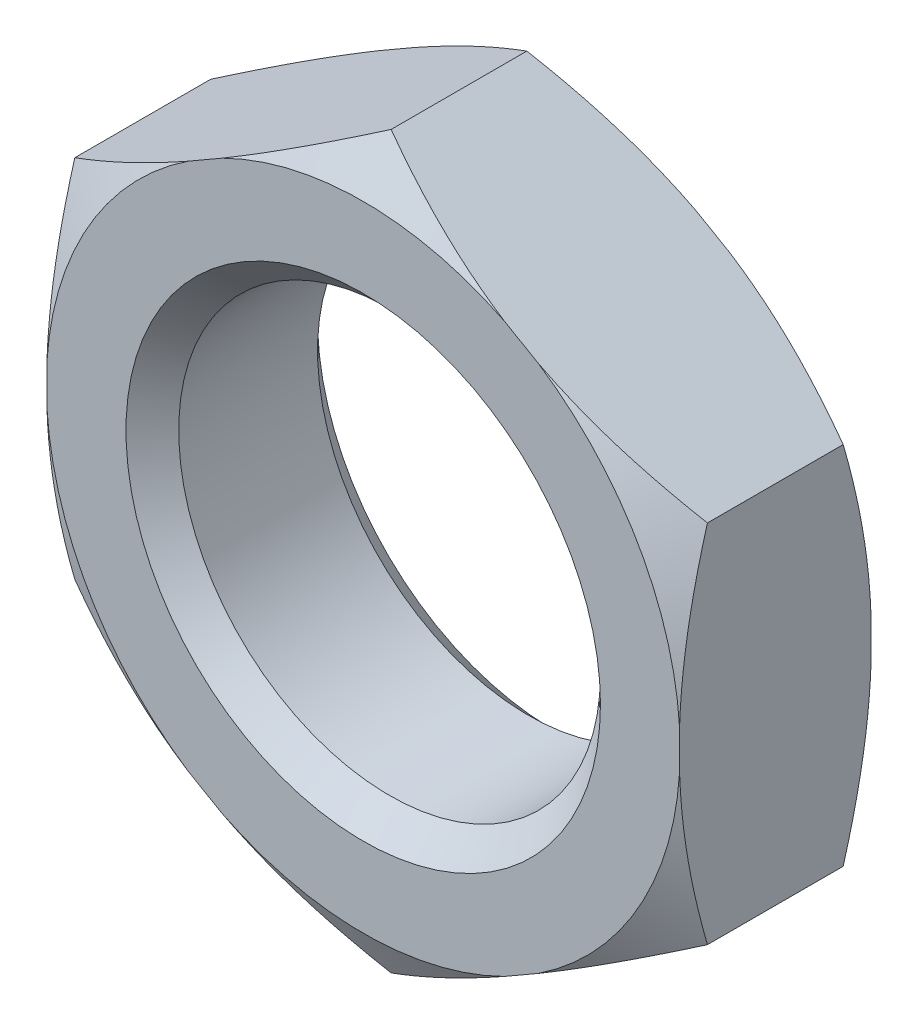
from build123d import *

# Parameters (mm, degrees)
BOSS_EXTRUDE1_DEPTH = 5.45
SKETCH6_R           = 12
CUT_EXTRUDE1_DEPTH  = 10.9
CHAMFER1_SIZE       = 1.5


with BuildPart() as part:
    # Sketch3 → Boss-Extrude1 (new, symmetric)
    with BuildSketch(Plane.XY):
        Polygon((0, 20.784609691), (-18, 10.392304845), (-18, -10.392304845), (0, -20.784609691), (18, -10.392304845), (18, 10.392304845), align=None)
    extrude(amount=BOSS_EXTRUDE1_DEPTH, both=True)

    # Sketch5 → Cut-Revolve1 (revolve, cut)
    with BuildSketch(Plane(origin=(0, 0, 0), x_dir=(0, 0, -1), z_dir=(1, 0, 0))):
        Polygon((-5.45, 20.784609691), (-5.45, 18.034609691), (-3.86228676, 20.784609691), align=None)
    cut_revolve1 = revolve(axis=Axis((0, 0, 5.457798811), (0, 0, -1)), mode=Mode.SUBTRACT)

    # Mirror1: Cut-Revolve1 across plane
    add(cut_revolve1.mirror(Plane.XY), mode=Mode.SUBTRACT)

    # Sketch6 → Cut-Extrude1 (cut)
    with BuildSketch(Plane.XY.offset(5.45)):
        Circle(SKETCH6_R)
    extrude(amount=-CUT_EXTRUDE1_DEPTH, mode=Mode.SUBTRACT)

    # Chamfer1
    chamfer1_edges = [part.edges().sort_by_distance(p)[0] for p in [
        (-12, 0, -5.45),
        (-12, 0, 5.45),
    ]]
    chamfer(chamfer1_edges, length=CHAMFER1_SIZE)


solid = part.part
